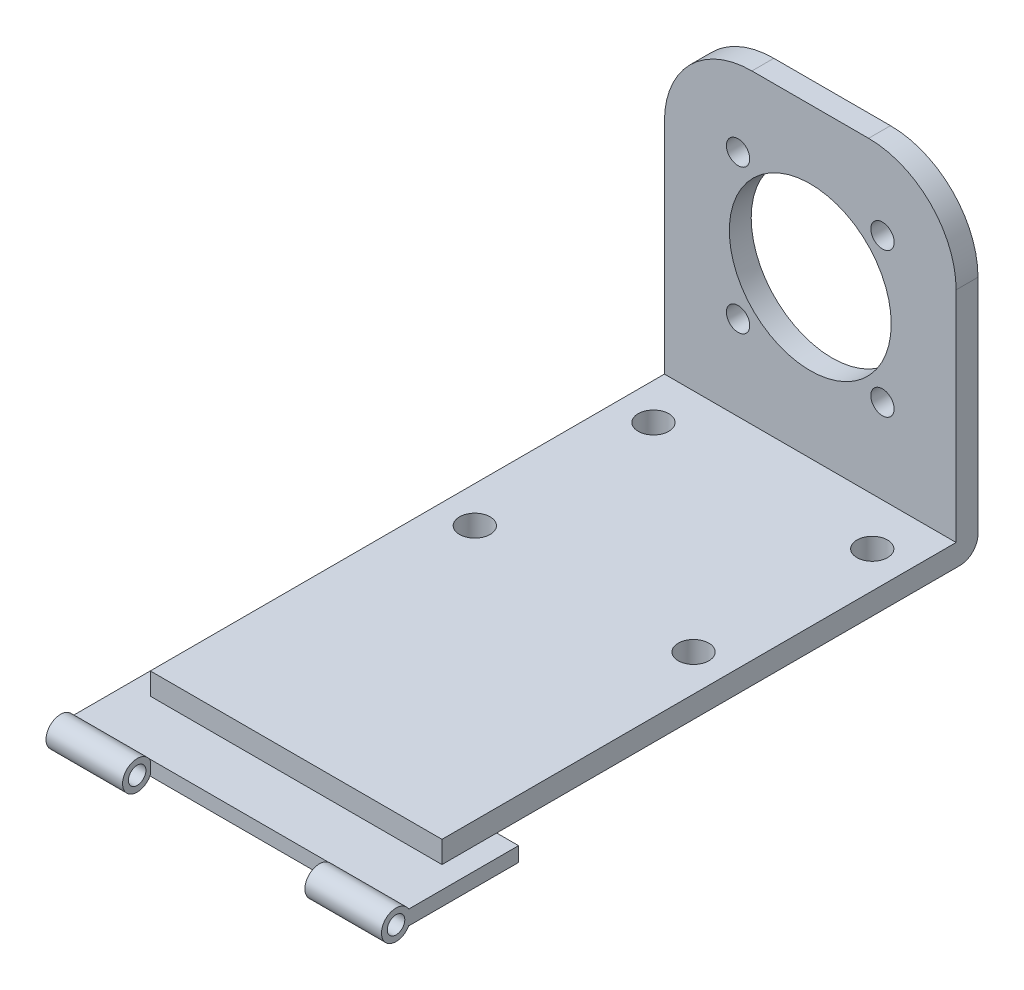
ISO-10303-21;
HEADER;
FILE_DESCRIPTION(('STEP AP214'),'2;1');
FILE_NAME('part.step','',(''),(''),'','','');
FILE_SCHEMA(('AUTOMOTIVE_DESIGN { 1 0 10303 214 1 1 1 1 }'));
ENDSEC;
DATA;
#1=APPLICATION_CONTEXT('core data for automotive mechanical design processes');
#2=APPLICATION_PROTOCOL_DEFINITION('international standard','automotive_design',2000,#1);
#3=PRODUCT_CONTEXT('',#1,'mechanical');
#4=PRODUCT('Part','Part','',(#3));
#5=PRODUCT_RELATED_PRODUCT_CATEGORY('part','',(#4));
#6=PRODUCT_DEFINITION_FORMATION('','',#4);
#7=PRODUCT_DEFINITION_CONTEXT('part definition',#1,'design');
#8=PRODUCT_DEFINITION('design','',#6,#7);
#9=PRODUCT_DEFINITION_SHAPE('','',#8);
#10=(LENGTH_UNIT() NAMED_UNIT(*) SI_UNIT(.MILLI.,.METRE.));
#11=(NAMED_UNIT(*) PLANE_ANGLE_UNIT() SI_UNIT($,.RADIAN.));
#12=(NAMED_UNIT(*) SI_UNIT($,.STERADIAN.) SOLID_ANGLE_UNIT());
#13=UNCERTAINTY_MEASURE_WITH_UNIT(LENGTH_MEASURE(1.E-05),#10,'distance_accuracy_value','');
#14=(GEOMETRIC_REPRESENTATION_CONTEXT(3) GLOBAL_UNCERTAINTY_ASSIGNED_CONTEXT((#13)) GLOBAL_UNIT_ASSIGNED_CONTEXT((#10,
#11,#12)) REPRESENTATION_CONTEXT('',''));
#15=CARTESIAN_POINT('',(0.,0.,0.));
#16=DIRECTION('',(0.,0.,1.));
#17=DIRECTION('',(1.,0.,0.));
#18=AXIS2_PLACEMENT_3D('',#15,#16,#17);
#19=CARTESIAN_POINT('',(0.,-11.580539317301,0.));
#20=DIRECTION('',(0.,-1.,0.));
#21=DIRECTION('',(0.,0.,-1.));
#22=AXIS2_PLACEMENT_3D('',#19,#20,#21);
#23=PLANE('',#22);
#24=DIRECTION('',(0.,0.,1.));
#25=VECTOR('',#24,1.);
#26=CARTESIAN_POINT('',(2.99999999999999,-11.580539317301,0.));
#27=LINE('',#26,#25);
#28=CARTESIAN_POINT('',(2.99999999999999,-11.580539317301,39.8535537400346));
#29=VERTEX_POINT('',#28);
#30=CARTESIAN_POINT('',(2.99999999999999,-11.580539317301,54.8535537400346));
#31=VERTEX_POINT('',#30);
#32=EDGE_CURVE('E588',#29,#31,#27,.T.);
#33=ORIENTED_EDGE('',*,*,#32,.F.);
#34=DIRECTION('',(1.,0.,0.));
#35=VECTOR('',#34,1.);
#36=CARTESIAN_POINT('',(-45.,-11.580539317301,39.8535537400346));
#37=LINE('',#36,#35);
#38=CARTESIAN_POINT('',(0.,-11.580539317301,39.8535537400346));
#39=VERTEX_POINT('',#38);
#40=EDGE_CURVE('E435',#39,#29,#37,.T.);
#41=ORIENTED_EDGE('',*,*,#40,.F.);
#42=DIRECTION('',(0.,0.,-1.));
#43=VECTOR('',#42,1.);
#44=CARTESIAN_POINT('',(0.,-11.580539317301,15.3535537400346));
#45=LINE('',#44,#43);
#46=CARTESIAN_POINT('',(0.,-11.580539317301,47.3535537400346));
#47=VERTEX_POINT('',#46);
#48=EDGE_CURVE('E549',#47,#39,#45,.T.);
#49=ORIENTED_EDGE('',*,*,#48,.F.);
#50=DIRECTION('',(-1.,0.,0.));
#51=VECTOR('',#50,1.);
#52=CARTESIAN_POINT('',(32.1403173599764,-11.580539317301,47.3535537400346));
#53=LINE('',#52,#51);
#54=CARTESIAN_POINT('',(-40.,-11.580539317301,47.3535537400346));
#55=VERTEX_POINT('',#54);
#56=EDGE_CURVE('E442',#47,#55,#53,.T.);
#57=ORIENTED_EDGE('',*,*,#56,.T.);
#58=DIRECTION('',(0.,0.,-1.));
#59=VECTOR('',#58,1.);
#60=CARTESIAN_POINT('',(-40.,-11.580539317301,15.3535537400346));
#61=LINE('',#60,#59);
#62=CARTESIAN_POINT('',(-40.,-11.580539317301,39.8535537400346));
#63=VERTEX_POINT('',#62);
#64=EDGE_CURVE('E536',#55,#63,#61,.T.);
#65=ORIENTED_EDGE('',*,*,#64,.T.);
#66=CARTESIAN_POINT('',(-43.,-11.580539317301,39.8535537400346));
#67=VERTEX_POINT('',#66);
#68=EDGE_CURVE('E427',#67,#63,#37,.T.);
#69=ORIENTED_EDGE('',*,*,#68,.F.);
#70=DIRECTION('',(0.,0.,-1.));
#71=VECTOR('',#70,1.);
#72=CARTESIAN_POINT('',(-43.,-11.580539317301,0.));
#73=LINE('',#72,#71);
#74=CARTESIAN_POINT('',(-43.,-11.580539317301,54.8535537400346));
#75=VERTEX_POINT('',#74);
#76=EDGE_CURVE('E599',#75,#67,#73,.T.);
#77=ORIENTED_EDGE('',*,*,#76,.F.);
#78=DIRECTION('',(-1.,0.,0.));
#79=VECTOR('',#78,1.);
#80=CARTESIAN_POINT('',(-45.,-11.580539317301,54.8535537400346));
#81=LINE('',#80,#79);
#82=EDGE_CURVE('E423',#31,#75,#81,.T.);
#83=ORIENTED_EDGE('',*,*,#82,.F.);
#84=EDGE_LOOP('',(#33,#41,#49,#57,#65,#69,#77,#83));
#85=FACE_BOUND('',#84,.T.);
#86=ADVANCED_FACE('F71',(#85),#23,.F.);
#87=CARTESIAN_POINT('',(-45.,-13.580539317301,54.8535537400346));
#88=DIRECTION('',(0.,0.,-1.));
#89=DIRECTION('',(-1.,0.,0.));
#90=AXIS2_PLACEMENT_3D('',#87,#88,#89);
#91=PLANE('',#90);
#92=DIRECTION('',(0.,-1.,0.));
#93=VECTOR('',#92,1.);
#94=CARTESIAN_POINT('',(2.99999999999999,-13.580539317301,54.8535537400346));
#95=LINE('',#94,#93);
#96=CARTESIAN_POINT('',(2.99999999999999,-11.7087595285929,54.8535537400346));
#97=VERTEX_POINT('',#96);
#98=EDGE_CURVE('E97',#31,#97,#95,.T.);
#99=ORIENTED_EDGE('',*,*,#98,.F.);
#100=ORIENTED_EDGE('',*,*,#82,.T.);
#101=DIRECTION('',(0.,1.,0.));
#102=VECTOR('',#101,1.);
#103=CARTESIAN_POINT('',(-43.,-13.580539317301,54.8535537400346));
#104=LINE('',#103,#102);
#105=CARTESIAN_POINT('',(-43.,-11.7087595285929,54.8535537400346));
#106=VERTEX_POINT('',#105);
#107=EDGE_CURVE('E604',#106,#75,#104,.T.);
#108=ORIENTED_EDGE('',*,*,#107,.F.);
#109=DIRECTION('',(-1.,0.,0.));
#110=VECTOR('',#109,1.);
#111=CARTESIAN_POINT('',(-32.5,-11.7087595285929,54.8535537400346));
#112=LINE('',#111,#110);
#113=CARTESIAN_POINT('',(-32.5,-11.7087595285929,54.8535537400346));
#114=VERTEX_POINT('',#113);
#115=EDGE_CURVE('E409',#106,#114,#112,.F.);
#116=ORIENTED_EDGE('',*,*,#115,.T.);
#117=DIRECTION('',(0.,1.,0.));
#118=VECTOR('',#117,1.);
#119=CARTESIAN_POINT('',(-32.5,-13.580539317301,54.8535537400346));
#120=LINE('',#119,#118);
#121=CARTESIAN_POINT('',(-32.5,-13.4523191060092,54.8535537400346));
#122=VERTEX_POINT('',#121);
#123=EDGE_CURVE('E223',#122,#114,#120,.T.);
#124=ORIENTED_EDGE('',*,*,#123,.F.);
#125=DIRECTION('',(-1.,0.,0.));
#126=VECTOR('',#125,1.);
#127=CARTESIAN_POINT('',(-32.5,-13.4523191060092,54.8535537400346));
#128=LINE('',#127,#126);
#129=CARTESIAN_POINT('',(-43.,-13.4523191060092,54.8535537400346));
#130=VERTEX_POINT('',#129);
#131=EDGE_CURVE('E410',#122,#130,#128,.T.);
#132=ORIENTED_EDGE('',*,*,#131,.T.);
#133=CARTESIAN_POINT('',(-43.,-13.580539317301,54.8535537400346));
#134=VERTEX_POINT('',#133);
#135=EDGE_CURVE('E89',#134,#130,#104,.T.);
#136=ORIENTED_EDGE('',*,*,#135,.F.);
#137=DIRECTION('',(-1.,0.,0.));
#138=VECTOR('',#137,1.);
#139=CARTESIAN_POINT('',(-45.,-13.580539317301,54.8535537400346));
#140=LINE('',#139,#138);
#141=CARTESIAN_POINT('',(2.99999999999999,-13.580539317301,54.8535537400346));
#142=VERTEX_POINT('',#141);
#143=EDGE_CURVE('E212',#142,#134,#140,.T.);
#144=ORIENTED_EDGE('',*,*,#143,.F.);
#145=CARTESIAN_POINT('',(2.99999999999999,-13.4523191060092,54.8535537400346));
#146=VERTEX_POINT('',#145);
#147=EDGE_CURVE('E199',#146,#142,#95,.T.);
#148=ORIENTED_EDGE('',*,*,#147,.F.);
#149=DIRECTION('',(1.,0.,0.));
#150=VECTOR('',#149,1.);
#151=CARTESIAN_POINT('',(-7.50000000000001,-13.4523191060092,54.8535537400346));
#152=LINE('',#151,#150);
#153=CARTESIAN_POINT('',(-7.50000000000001,-13.4523191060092,54.8535537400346));
#154=VERTEX_POINT('',#153);
#155=EDGE_CURVE('E81',#146,#154,#152,.F.);
#156=ORIENTED_EDGE('',*,*,#155,.T.);
#157=DIRECTION('',(0.,-1.,0.));
#158=VECTOR('',#157,1.);
#159=CARTESIAN_POINT('',(-7.50000000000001,-13.580539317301,54.8535537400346));
#160=LINE('',#159,#158);
#161=CARTESIAN_POINT('',(-7.50000000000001,-11.7087595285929,54.8535537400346));
#162=VERTEX_POINT('',#161);
#163=EDGE_CURVE('E220',#162,#154,#160,.T.);
#164=ORIENTED_EDGE('',*,*,#163,.F.);
#165=DIRECTION('',(1.,0.,0.));
#166=VECTOR('',#165,1.);
#167=CARTESIAN_POINT('',(-7.50000000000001,-11.7087595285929,54.8535537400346));
#168=LINE('',#167,#166);
#169=EDGE_CURVE('E12',#162,#97,#168,.T.);
#170=ORIENTED_EDGE('',*,*,#169,.T.);
#171=EDGE_LOOP('',(#99,#100,#108,#116,#124,#132,#136,#144,#148,#156,#164,#170));
#172=FACE_BOUND('',#171,.T.);
#173=ADVANCED_FACE('F209',(#172),#91,.F.);
#174=CARTESIAN_POINT('',(-45.,-13.580539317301,39.8535537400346));
#175=DIRECTION('',(0.,0.,1.));
#176=DIRECTION('',(1.,0.,0.));
#177=AXIS2_PLACEMENT_3D('',#174,#175,#176);
#178=PLANE('',#177);
#179=DIRECTION('',(0.,1.,0.));
#180=VECTOR('',#179,1.);
#181=CARTESIAN_POINT('',(2.99999999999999,-13.580539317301,39.8535537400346));
#182=LINE('',#181,#180);
#183=CARTESIAN_POINT('',(2.99999999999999,-13.580539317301,39.8535537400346));
#184=VERTEX_POINT('',#183);
#185=EDGE_CURVE('E612',#184,#29,#182,.T.);
#186=ORIENTED_EDGE('',*,*,#185,.F.);
#187=DIRECTION('',(1.,0.,0.));
#188=VECTOR('',#187,1.);
#189=CARTESIAN_POINT('',(-45.,-13.580539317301,39.8535537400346));
#190=LINE('',#189,#188);
#191=CARTESIAN_POINT('',(-43.,-13.580539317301,39.8535537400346));
#192=VERTEX_POINT('',#191);
#193=EDGE_CURVE('E426',#192,#184,#190,.T.);
#194=ORIENTED_EDGE('',*,*,#193,.F.);
#195=DIRECTION('',(0.,-1.,0.));
#196=VECTOR('',#195,1.);
#197=CARTESIAN_POINT('',(-43.,-13.580539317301,39.8535537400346));
#198=LINE('',#197,#196);
#199=EDGE_CURVE('E623',#67,#192,#198,.T.);
#200=ORIENTED_EDGE('',*,*,#199,.F.);
#201=ORIENTED_EDGE('',*,*,#68,.T.);
#202=EDGE_CURVE('E438',#63,#39,#37,.T.);
#203=ORIENTED_EDGE('',*,*,#202,.T.);
#204=ORIENTED_EDGE('',*,*,#40,.T.);
#205=EDGE_LOOP('',(#186,#194,#200,#201,#203,#204));
#206=FACE_BOUND('',#205,.T.);
#207=ADVANCED_FACE('F255',(#206),#178,.F.);
#208=CARTESIAN_POINT('',(0.,-13.580539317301,0.));
#209=DIRECTION('',(0.,-1.,0.));
#210=DIRECTION('',(0.,0.,-1.));
#211=AXIS2_PLACEMENT_3D('',#208,#209,#210);
#212=PLANE('',#211);
#213=ORIENTED_EDGE('',*,*,#193,.T.);
#214=DIRECTION('',(0.,0.,1.));
#215=VECTOR('',#214,1.);
#216=CARTESIAN_POINT('',(2.99999999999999,-13.580539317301,0.));
#217=LINE('',#216,#215);
#218=EDGE_CURVE('E607',#184,#142,#217,.T.);
#219=ORIENTED_EDGE('',*,*,#218,.T.);
#220=ORIENTED_EDGE('',*,*,#143,.T.);
#221=DIRECTION('',(0.,0.,-1.));
#222=VECTOR('',#221,1.);
#223=CARTESIAN_POINT('',(-43.,-13.580539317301,0.));
#224=LINE('',#223,#222);
#225=EDGE_CURVE('E601',#134,#192,#224,.T.);
#226=ORIENTED_EDGE('',*,*,#225,.T.);
#227=EDGE_LOOP('',(#213,#219,#220,#226));
#228=FACE_BOUND('',#227,.T.);
#229=ADVANCED_FACE('F260',(#228),#212,.T.);
#230=CARTESIAN_POINT('',(-32.5,-12.580539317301,56.6535537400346));
#231=DIRECTION('',(-1.,0.,0.));
#232=DIRECTION('',(0.,0.,1.));
#233=AXIS2_PLACEMENT_3D('',#230,#231,#232);
#234=CYLINDRICAL_SURFACE('',#233,2.);
#235=ORIENTED_EDGE('',*,*,#115,.F.);
#236=CARTESIAN_POINT('',(-43.,-12.580539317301,56.6535537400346));
#237=DIRECTION('',(-1.,0.,0.));
#238=DIRECTION('',(0.,0.,1.));
#239=AXIS2_PLACEMENT_3D('',#236,#237,#238);
#240=CIRCLE('',#239,2.);
#241=EDGE_CURVE('E615',#106,#130,#240,.F.);
#242=ORIENTED_EDGE('',*,*,#241,.T.);
#243=ORIENTED_EDGE('',*,*,#131,.F.);
#244=CARTESIAN_POINT('',(-32.5,-12.580539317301,56.6535537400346));
#245=DIRECTION('',(-1.,0.,0.));
#246=DIRECTION('',(0.,0.,1.));
#247=AXIS2_PLACEMENT_3D('',#244,#245,#246);
#248=CIRCLE('',#247,2.);
#249=EDGE_CURVE('E404',#122,#114,#248,.T.);
#250=ORIENTED_EDGE('',*,*,#249,.T.);
#251=EDGE_LOOP('',(#235,#242,#243,#250));
#252=FACE_BOUND('',#251,.T.);
#253=ADVANCED_FACE('F408',(#252),#234,.T.);
#254=CARTESIAN_POINT('',(-32.5,-12.580539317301,56.6535537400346));
#255=DIRECTION('',(-1.,0.,0.));
#256=DIRECTION('',(0.,0.,1.));
#257=AXIS2_PLACEMENT_3D('',#254,#255,#256);
#258=CYLINDRICAL_SURFACE('',#257,1.2);
#259=CARTESIAN_POINT('',(-32.5,-12.580539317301,56.6535537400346));
#260=DIRECTION('',(-1.,0.,0.));
#261=DIRECTION('',(0.,0.,1.));
#262=AXIS2_PLACEMENT_3D('',#259,#260,#261);
#263=CIRCLE('',#262,1.2);
#264=CARTESIAN_POINT('',(-32.5,-12.580539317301,57.8535537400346));
#265=VERTEX_POINT('',#264);
#266=EDGE_CURVE('E412',#265,#265,#263,.T.);
#267=ORIENTED_EDGE('',*,*,#266,.F.);
#268=EDGE_LOOP('',(#267));
#269=FACE_BOUND('',#268,.T.);
#270=CARTESIAN_POINT('',(-43.,-12.580539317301,56.6535537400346));
#271=DIRECTION('',(-1.,0.,0.));
#272=DIRECTION('',(0.,0.,1.));
#273=AXIS2_PLACEMENT_3D('',#270,#271,#272);
#274=CIRCLE('',#273,1.2);
#275=CARTESIAN_POINT('',(-43.,-12.580539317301,57.8535537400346));
#276=VERTEX_POINT('',#275);
#277=EDGE_CURVE('E75',#276,#276,#274,.F.);
#278=ORIENTED_EDGE('',*,*,#277,.F.);
#279=EDGE_LOOP('',(#278));
#280=FACE_BOUND('',#279,.T.);
#281=ADVANCED_FACE('F243',(#269,#280),#258,.F.);
#282=CARTESIAN_POINT('',(-7.50000000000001,-12.580539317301,56.6535537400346));
#283=DIRECTION('',(1.,0.,0.));
#284=DIRECTION('',(0.,0.,-1.));
#285=AXIS2_PLACEMENT_3D('',#282,#283,#284);
#286=CYLINDRICAL_SURFACE('',#285,2.);
#287=ORIENTED_EDGE('',*,*,#155,.F.);
#288=CARTESIAN_POINT('',(2.99999999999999,-12.580539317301,56.6535537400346));
#289=DIRECTION('',(1.,0.,0.));
#290=DIRECTION('',(0.,0.,-1.));
#291=AXIS2_PLACEMENT_3D('',#288,#289,#290);
#292=CIRCLE('',#291,2.);
#293=EDGE_CURVE('E196',#146,#97,#292,.F.);
#294=ORIENTED_EDGE('',*,*,#293,.T.);
#295=ORIENTED_EDGE('',*,*,#169,.F.);
#296=CARTESIAN_POINT('',(-7.50000000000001,-12.580539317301,56.6535537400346));
#297=DIRECTION('',(1.,0.,0.));
#298=DIRECTION('',(0.,0.,-1.));
#299=AXIS2_PLACEMENT_3D('',#296,#297,#298);
#300=CIRCLE('',#299,2.);
#301=EDGE_CURVE('E218',#162,#154,#300,.T.);
#302=ORIENTED_EDGE('',*,*,#301,.T.);
#303=EDGE_LOOP('',(#287,#294,#295,#302));
#304=FACE_BOUND('',#303,.T.);
#305=ADVANCED_FACE('F216',(#304),#286,.T.);
#306=CARTESIAN_POINT('',(-7.50000000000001,-12.580539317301,56.6535537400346));
#307=DIRECTION('',(1.,0.,0.));
#308=DIRECTION('',(0.,0.,-1.));
#309=AXIS2_PLACEMENT_3D('',#306,#307,#308);
#310=CYLINDRICAL_SURFACE('',#309,1.2);
#311=CARTESIAN_POINT('',(-7.50000000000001,-12.580539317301,56.6535537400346));
#312=DIRECTION('',(1.,0.,0.));
#313=DIRECTION('',(0.,0.,-1.));
#314=AXIS2_PLACEMENT_3D('',#311,#312,#313);
#315=CIRCLE('',#314,1.2);
#316=CARTESIAN_POINT('',(-7.50000000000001,-12.580539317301,55.4535537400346));
#317=VERTEX_POINT('',#316);
#318=EDGE_CURVE('E626',#317,#317,#315,.T.);
#319=ORIENTED_EDGE('',*,*,#318,.F.);
#320=EDGE_LOOP('',(#319));
#321=FACE_BOUND('',#320,.T.);
#322=CARTESIAN_POINT('',(2.99999999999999,-12.580539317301,56.6535537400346));
#323=DIRECTION('',(1.,0.,0.));
#324=DIRECTION('',(0.,0.,-1.));
#325=AXIS2_PLACEMENT_3D('',#322,#323,#324);
#326=CIRCLE('',#325,1.2);
#327=CARTESIAN_POINT('',(2.99999999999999,-12.580539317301,55.4535537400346));
#328=VERTEX_POINT('',#327);
#329=EDGE_CURVE('E205',#328,#328,#326,.F.);
#330=ORIENTED_EDGE('',*,*,#329,.F.);
#331=EDGE_LOOP('',(#330));
#332=FACE_BOUND('',#331,.T.);
#333=ADVANCED_FACE('F231',(#321,#332),#310,.F.);
#334=CARTESIAN_POINT('',(-40.,-11.580539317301,15.3535537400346));
#335=DIRECTION('',(0.,-1.,0.));
#336=DIRECTION('',(0.,0.,-1.));
#337=AXIS2_PLACEMENT_3D('',#334,#335,#336);
#338=PLANE('',#337);
#339=CARTESIAN_POINT('',(-35.,-11.580539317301,-16.6464462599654));
#340=DIRECTION('',(0.,-1.,0.));
#341=DIRECTION('',(0.,0.,-1.));
#342=AXIS2_PLACEMENT_3D('',#339,#340,#341);
#343=CIRCLE('',#342,2.1);
#344=CARTESIAN_POINT('',(-35.,-11.580539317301,-18.7464462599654));
#345=VERTEX_POINT('',#344);
#346=EDGE_CURVE('E482',#345,#345,#343,.T.);
#347=ORIENTED_EDGE('',*,*,#346,.F.);
#348=EDGE_LOOP('',(#347));
#349=FACE_BOUND('',#348,.T.);
#350=CARTESIAN_POINT('',(-5.,-11.580539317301,7.85355374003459));
#351=DIRECTION('',(0.,-1.,0.));
#352=DIRECTION('',(0.,0.,-1.));
#353=AXIS2_PLACEMENT_3D('',#350,#351,#352);
#354=CIRCLE('',#353,2.1);
#355=CARTESIAN_POINT('',(-5.,-11.580539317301,5.75355374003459));
#356=VERTEX_POINT('',#355);
#357=EDGE_CURVE('E478',#356,#356,#354,.T.);
#358=ORIENTED_EDGE('',*,*,#357,.F.);
#359=EDGE_LOOP('',(#358));
#360=FACE_BOUND('',#359,.T.);
#361=CARTESIAN_POINT('',(-5.,-11.580539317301,-16.6464462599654));
#362=DIRECTION('',(0.,-1.,0.));
#363=DIRECTION('',(0.,0.,-1.));
#364=AXIS2_PLACEMENT_3D('',#361,#362,#363);
#365=CIRCLE('',#364,2.1);
#366=CARTESIAN_POINT('',(-5.,-11.580539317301,-18.7464462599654));
#367=VERTEX_POINT('',#366);
#368=EDGE_CURVE('E474',#367,#367,#365,.T.);
#369=ORIENTED_EDGE('',*,*,#368,.F.);
#370=EDGE_LOOP('',(#369));
#371=FACE_BOUND('',#370,.T.);
#372=CARTESIAN_POINT('',(-35.,-11.580539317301,7.8535537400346));
#373=DIRECTION('',(0.,-1.,0.));
#374=DIRECTION('',(0.,0.,-1.));
#375=AXIS2_PLACEMENT_3D('',#372,#373,#374);
#376=CIRCLE('',#375,2.1);
#377=CARTESIAN_POINT('',(-35.,-11.580539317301,5.7535537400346));
#378=VERTEX_POINT('',#377);
#379=EDGE_CURVE('E470',#378,#378,#376,.T.);
#380=ORIENTED_EDGE('',*,*,#379,.F.);
#381=EDGE_LOOP('',(#380));
#382=FACE_BOUND('',#381,.T.);
#383=CARTESIAN_POINT('',(0.,-11.580539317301,-23.6464462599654));
#384=VERTEX_POINT('',#383);
#385=EDGE_CURVE('E548',#39,#384,#45,.T.);
#386=ORIENTED_EDGE('',*,*,#385,.F.);
#387=ORIENTED_EDGE('',*,*,#202,.F.);
#388=CARTESIAN_POINT('',(-40.,-11.580539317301,-23.6464462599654));
#389=VERTEX_POINT('',#388);
#390=EDGE_CURVE('E535',#63,#389,#61,.T.);
#391=ORIENTED_EDGE('',*,*,#390,.T.);
#392=DIRECTION('',(1.,0.,0.));
#393=VECTOR('',#392,1.);
#394=CARTESIAN_POINT('',(-40.,-11.580539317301,-23.6464462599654));
#395=LINE('',#394,#393);
#396=EDGE_CURVE('E384',#389,#384,#395,.T.);
#397=ORIENTED_EDGE('',*,*,#396,.T.);
#398=EDGE_LOOP('',(#386,#387,#391,#397));
#399=FACE_BOUND('',#398,.T.);
#400=ADVANCED_FACE('F233',(#349,#360,#371,#382,#399),#338,.T.);
#401=CARTESIAN_POINT('',(-40.,33.419460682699,-26.1464462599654));
#402=DIRECTION('',(0.,1.,0.));
#403=DIRECTION('',(0.,0.,1.));
#404=AXIS2_PLACEMENT_3D('',#401,#402,#403);
#405=PLANE('',#404);
#406=DIRECTION('',(1.,0.,0.));
#407=VECTOR('',#406,1.);
#408=CARTESIAN_POINT('',(-40.,33.419460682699,-23.1464462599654));
#409=LINE('',#408,#407);
#410=CARTESIAN_POINT('',(-27.9999999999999,33.419460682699,-23.1464462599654));
#411=VERTEX_POINT('',#410);
#412=CARTESIAN_POINT('',(-12.0000000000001,33.419460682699,-23.1464462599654));
#413=VERTEX_POINT('',#412);
#414=EDGE_CURVE('E364',#411,#413,#409,.T.);
#415=ORIENTED_EDGE('',*,*,#414,.T.);
#416=DIRECTION('',(0.,0.,1.));
#417=VECTOR('',#416,1.);
#418=CARTESIAN_POINT('',(-12.0000000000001,33.419460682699,-63.1464462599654));
#419=LINE('',#418,#417);
#420=CARTESIAN_POINT('',(-12.0000000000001,33.419460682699,-26.1464462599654));
#421=VERTEX_POINT('',#420);
#422=EDGE_CURVE('E369',#421,#413,#419,.T.);
#423=ORIENTED_EDGE('',*,*,#422,.F.);
#424=DIRECTION('',(1.,0.,0.));
#425=VECTOR('',#424,1.);
#426=CARTESIAN_POINT('',(-40.,33.419460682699,-26.1464462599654));
#427=LINE('',#426,#425);
#428=CARTESIAN_POINT('',(-27.9999999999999,33.419460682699,-26.1464462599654));
#429=VERTEX_POINT('',#428);
#430=EDGE_CURVE('E395',#429,#421,#427,.T.);
#431=ORIENTED_EDGE('',*,*,#430,.F.);
#432=DIRECTION('',(0.,0.,1.));
#433=VECTOR('',#432,1.);
#434=CARTESIAN_POINT('',(-27.9999999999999,33.419460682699,-63.1464462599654));
#435=LINE('',#434,#433);
#436=EDGE_CURVE('E377',#429,#411,#435,.T.);
#437=ORIENTED_EDGE('',*,*,#436,.T.);
#438=EDGE_LOOP('',(#415,#423,#431,#437));
#439=FACE_BOUND('',#438,.T.);
#440=ADVANCED_FACE('F73',(#439),#405,.T.);
#441=CARTESIAN_POINT('',(-40.,-9.08053931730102,-26.1464462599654));
#442=DIRECTION('',(0.,0.,-1.));
#443=DIRECTION('',(-1.,0.,0.));
#444=AXIS2_PLACEMENT_3D('',#441,#442,#443);
#445=PLANE('',#444);
#446=CARTESIAN_POINT('',(-29.8994949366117,22.8189556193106,-26.1464462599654));
#447=DIRECTION('',(0.,0.,-1.));
#448=DIRECTION('',(-1.,0.,0.));
#449=AXIS2_PLACEMENT_3D('',#446,#447,#448);
#450=CIRCLE('',#449,1.6);
#451=CARTESIAN_POINT('',(-31.4994949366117,22.8189556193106,-26.1464462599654));
#452=VERTEX_POINT('',#451);
#453=EDGE_CURVE('E524',#452,#452,#450,.T.);
#454=ORIENTED_EDGE('',*,*,#453,.F.);
#455=EDGE_LOOP('',(#454));
#456=FACE_BOUND('',#455,.T.);
#457=CARTESIAN_POINT('',(-10.1005050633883,22.8189556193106,-26.1464462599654));
#458=DIRECTION('',(0.,0.,-1.));
#459=DIRECTION('',(-1.,0.,0.));
#460=AXIS2_PLACEMENT_3D('',#457,#458,#459);
#461=CIRCLE('',#460,1.6);
#462=CARTESIAN_POINT('',(-11.7005050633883,22.8189556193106,-26.1464462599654));
#463=VERTEX_POINT('',#462);
#464=EDGE_CURVE('E520',#463,#463,#461,.T.);
#465=ORIENTED_EDGE('',*,*,#464,.F.);
#466=EDGE_LOOP('',(#465));
#467=FACE_BOUND('',#466,.T.);
#468=CARTESIAN_POINT('',(-10.1005050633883,3.01996574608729,-26.1464462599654));
#469=DIRECTION('',(0.,0.,-1.));
#470=DIRECTION('',(-1.,0.,0.));
#471=AXIS2_PLACEMENT_3D('',#468,#469,#470);
#472=CIRCLE('',#471,1.6);
#473=CARTESIAN_POINT('',(-11.7005050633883,3.01996574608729,-26.1464462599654));
#474=VERTEX_POINT('',#473);
#475=EDGE_CURVE('E516',#474,#474,#472,.T.);
#476=ORIENTED_EDGE('',*,*,#475,.F.);
#477=EDGE_LOOP('',(#476));
#478=FACE_BOUND('',#477,.T.);
#479=CARTESIAN_POINT('',(-29.8994949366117,3.01996574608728,-26.1464462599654));
#480=DIRECTION('',(0.,0.,-1.));
#481=DIRECTION('',(-1.,0.,0.));
#482=AXIS2_PLACEMENT_3D('',#479,#480,#481);
#483=CIRCLE('',#482,1.6);
#484=CARTESIAN_POINT('',(-31.4994949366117,3.01996574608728,-26.1464462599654));
#485=VERTEX_POINT('',#484);
#486=EDGE_CURVE('E512',#485,#485,#483,.T.);
#487=ORIENTED_EDGE('',*,*,#486,.F.);
#488=EDGE_LOOP('',(#487));
#489=FACE_BOUND('',#488,.T.);
#490=CARTESIAN_POINT('',(-20.,12.919460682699,-26.1464462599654));
#491=DIRECTION('',(0.,0.,-1.));
#492=DIRECTION('',(-1.,0.,0.));
#493=AXIS2_PLACEMENT_3D('',#490,#491,#492);
#494=CIRCLE('',#493,11.1);
#495=CARTESIAN_POINT('',(-31.1,12.919460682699,-26.1464462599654));
#496=VERTEX_POINT('',#495);
#497=EDGE_CURVE('E508',#496,#496,#494,.T.);
#498=ORIENTED_EDGE('',*,*,#497,.F.);
#499=EDGE_LOOP('',(#498));
#500=FACE_BOUND('',#499,.T.);
#501=CARTESIAN_POINT('',(-12.,21.419460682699,-26.1464462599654));
#502=DIRECTION('',(0.,0.,-1.));
#503=DIRECTION('',(-1.,0.,0.));
#504=AXIS2_PLACEMENT_3D('',#501,#502,#503);
#505=CIRCLE('',#504,12.);
#506=CARTESIAN_POINT('',(0.,21.4194606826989,-26.1464462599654));
#507=VERTEX_POINT('',#506);
#508=EDGE_CURVE('E488',#507,#421,#505,.F.);
#509=ORIENTED_EDGE('',*,*,#508,.F.);
#510=DIRECTION('',(0.,1.,0.));
#511=VECTOR('',#510,1.);
#512=CARTESIAN_POINT('',(0.,-9.08053931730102,-26.1464462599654));
#513=LINE('',#512,#511);
#514=CARTESIAN_POINT('',(0.,-9.08053931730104,-26.1464462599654));
#515=VERTEX_POINT('',#514);
#516=EDGE_CURVE('E532',#515,#507,#513,.T.);
#517=ORIENTED_EDGE('',*,*,#516,.F.);
#518=DIRECTION('',(1.,0.,0.));
#519=VECTOR('',#518,1.);
#520=CARTESIAN_POINT('',(-40.,-9.08053931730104,-26.1464462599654));
#521=LINE('',#520,#519);
#522=CARTESIAN_POINT('',(-40.,-9.08053931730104,-26.1464462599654));
#523=VERTEX_POINT('',#522);
#524=EDGE_CURVE('E562',#523,#515,#521,.T.);
#525=ORIENTED_EDGE('',*,*,#524,.F.);
#526=DIRECTION('',(0.,1.,0.));
#527=VECTOR('',#526,1.);
#528=CARTESIAN_POINT('',(-40.,-9.08053931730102,-26.1464462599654));
#529=LINE('',#528,#527);
#530=CARTESIAN_POINT('',(-40.,21.4194606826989,-26.1464462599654));
#531=VERTEX_POINT('',#530);
#532=EDGE_CURVE('E380',#523,#531,#529,.T.);
#533=ORIENTED_EDGE('',*,*,#532,.T.);
#534=CARTESIAN_POINT('',(-28.,21.419460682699,-26.1464462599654));
#535=DIRECTION('',(0.,0.,-1.));
#536=DIRECTION('',(-1.,0.,0.));
#537=AXIS2_PLACEMENT_3D('',#534,#535,#536);
#538=CIRCLE('',#537,12.);
#539=EDGE_CURVE('E495',#429,#531,#538,.F.);
#540=ORIENTED_EDGE('',*,*,#539,.F.);
#541=ORIENTED_EDGE('',*,*,#430,.T.);
#542=EDGE_LOOP('',(#509,#517,#525,#533,#540,#541));
#543=FACE_BOUND('',#542,.T.);
#544=ADVANCED_FACE('F323',(#456,#467,#478,#489,#500,#543),#445,.T.);
#545=CARTESIAN_POINT('',(-40.,33.419460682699,-23.1464462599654));
#546=DIRECTION('',(0.,0.,1.));
#547=DIRECTION('',(0.,-1.,0.));
#548=AXIS2_PLACEMENT_3D('',#545,#546,#547);
#549=PLANE('',#548);
#550=CARTESIAN_POINT('',(-29.8994949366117,22.8189556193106,-23.1464462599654));
#551=DIRECTION('',(0.,0.,1.));
#552=DIRECTION('',(1.,0.,0.));
#553=AXIS2_PLACEMENT_3D('',#550,#551,#552);
#554=CIRCLE('',#553,1.6);
#555=CARTESIAN_POINT('',(-28.2994949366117,22.8189556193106,-23.1464462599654));
#556=VERTEX_POINT('',#555);
#557=EDGE_CURVE('E341',#556,#556,#554,.T.);
#558=ORIENTED_EDGE('',*,*,#557,.F.);
#559=EDGE_LOOP('',(#558));
#560=FACE_BOUND('',#559,.T.);
#561=CARTESIAN_POINT('',(-10.1005050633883,22.8189556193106,-23.1464462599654));
#562=DIRECTION('',(0.,0.,1.));
#563=DIRECTION('',(1.,0.,0.));
#564=AXIS2_PLACEMENT_3D('',#561,#562,#563);
#565=CIRCLE('',#564,1.6);
#566=CARTESIAN_POINT('',(-8.50050506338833,22.8189556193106,-23.1464462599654));
#567=VERTEX_POINT('',#566);
#568=EDGE_CURVE('E345',#567,#567,#565,.T.);
#569=ORIENTED_EDGE('',*,*,#568,.F.);
#570=EDGE_LOOP('',(#569));
#571=FACE_BOUND('',#570,.T.);
#572=CARTESIAN_POINT('',(-10.1005050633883,3.01996574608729,-23.1464462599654));
#573=DIRECTION('',(0.,0.,1.));
#574=DIRECTION('',(1.,0.,0.));
#575=AXIS2_PLACEMENT_3D('',#572,#573,#574);
#576=CIRCLE('',#575,1.6);
#577=CARTESIAN_POINT('',(-8.50050506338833,3.01996574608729,-23.1464462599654));
#578=VERTEX_POINT('',#577);
#579=EDGE_CURVE('E349',#578,#578,#576,.T.);
#580=ORIENTED_EDGE('',*,*,#579,.F.);
#581=EDGE_LOOP('',(#580));
#582=FACE_BOUND('',#581,.T.);
#583=CARTESIAN_POINT('',(-29.8994949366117,3.01996574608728,-23.1464462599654));
#584=DIRECTION('',(0.,0.,1.));
#585=DIRECTION('',(1.,0.,0.));
#586=AXIS2_PLACEMENT_3D('',#583,#584,#585);
#587=CIRCLE('',#586,1.6);
#588=CARTESIAN_POINT('',(-28.2994949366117,3.01996574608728,-23.1464462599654));
#589=VERTEX_POINT('',#588);
#590=EDGE_CURVE('E353',#589,#589,#587,.T.);
#591=ORIENTED_EDGE('',*,*,#590,.F.);
#592=EDGE_LOOP('',(#591));
#593=FACE_BOUND('',#592,.T.);
#594=CARTESIAN_POINT('',(-20.,12.919460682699,-23.1464462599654));
#595=DIRECTION('',(0.,0.,1.));
#596=DIRECTION('',(1.,0.,0.));
#597=AXIS2_PLACEMENT_3D('',#594,#595,#596);
#598=CIRCLE('',#597,11.1);
#599=CARTESIAN_POINT('',(-8.9,12.919460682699,-23.1464462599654));
#600=VERTEX_POINT('',#599);
#601=EDGE_CURVE('E357',#600,#600,#598,.T.);
#602=ORIENTED_EDGE('',*,*,#601,.F.);
#603=EDGE_LOOP('',(#602));
#604=FACE_BOUND('',#603,.T.);
#605=CARTESIAN_POINT('',(-12.,21.419460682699,-23.1464462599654));
#606=DIRECTION('',(0.,0.,-1.));
#607=DIRECTION('',(-1.,0.,0.));
#608=AXIS2_PLACEMENT_3D('',#605,#606,#607);
#609=CIRCLE('',#608,12.);
#610=CARTESIAN_POINT('',(0.,21.4194606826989,-23.1464462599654));
#611=VERTEX_POINT('',#610);
#612=EDGE_CURVE('E361',#413,#611,#609,.T.);
#613=ORIENTED_EDGE('',*,*,#612,.F.);
#614=ORIENTED_EDGE('',*,*,#414,.F.);
#615=CARTESIAN_POINT('',(-28.,21.419460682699,-23.1464462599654));
#616=DIRECTION('',(0.,0.,-1.));
#617=DIRECTION('',(1.,0.,0.));
#618=AXIS2_PLACEMENT_3D('',#615,#616,#617);
#619=CIRCLE('',#618,12.);
#620=CARTESIAN_POINT('',(-40.,21.4194606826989,-23.1464462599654));
#621=VERTEX_POINT('',#620);
#622=EDGE_CURVE('E370',#621,#411,#619,.T.);
#623=ORIENTED_EDGE('',*,*,#622,.F.);
#624=DIRECTION('',(0.,-1.,0.));
#625=VECTOR('',#624,1.);
#626=CARTESIAN_POINT('',(-40.,33.419460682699,-23.1464462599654));
#627=LINE('',#626,#625);
#628=CARTESIAN_POINT('',(-40.,-8.58053931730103,-23.1464462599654));
#629=VERTEX_POINT('',#628);
#630=EDGE_CURVE('E528',#621,#629,#627,.T.);
#631=ORIENTED_EDGE('',*,*,#630,.T.);
#632=DIRECTION('',(1.,0.,0.));
#633=VECTOR('',#632,1.);
#634=CARTESIAN_POINT('',(-40.,-8.58053931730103,-23.1464462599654));
#635=LINE('',#634,#633);
#636=CARTESIAN_POINT('',(0.,-8.58053931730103,-23.1464462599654));
#637=VERTEX_POINT('',#636);
#638=EDGE_CURVE('E379',#629,#637,#635,.T.);
#639=ORIENTED_EDGE('',*,*,#638,.T.);
#640=DIRECTION('',(0.,-1.,0.));
#641=VECTOR('',#640,1.);
#642=CARTESIAN_POINT('',(0.,33.419460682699,-23.1464462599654));
#643=LINE('',#642,#641);
#644=EDGE_CURVE('E366',#611,#637,#643,.T.);
#645=ORIENTED_EDGE('',*,*,#644,.F.);
#646=EDGE_LOOP('',(#613,#614,#623,#631,#639,#645));
#647=FACE_BOUND('',#646,.T.);
#648=ADVANCED_FACE('F326',(#560,#571,#582,#593,#604,#647),#549,.T.);
#649=CARTESIAN_POINT('',(-40.,-9.08053931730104,-23.6464462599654));
#650=DIRECTION('',(1.,0.,0.));
#651=DIRECTION('',(0.,0.,-1.));
#652=AXIS2_PLACEMENT_3D('',#649,#650,#651);
#653=CYLINDRICAL_SURFACE('',#652,2.5);
#654=CARTESIAN_POINT('',(0.,-9.08053931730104,-23.6464462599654));
#655=DIRECTION('',(1.,0.,0.));
#656=DIRECTION('',(0.,0.,-1.));
#657=AXIS2_PLACEMENT_3D('',#654,#655,#656);
#658=CIRCLE('',#657,2.5);
#659=EDGE_CURVE('E553',#384,#515,#658,.T.);
#660=ORIENTED_EDGE('',*,*,#659,.F.);
#661=ORIENTED_EDGE('',*,*,#396,.F.);
#662=CARTESIAN_POINT('',(-40.,-9.08053931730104,-23.6464462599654));
#663=DIRECTION('',(1.,0.,0.));
#664=DIRECTION('',(0.,0.,-1.));
#665=AXIS2_PLACEMENT_3D('',#662,#663,#664);
#666=CIRCLE('',#665,2.5);
#667=EDGE_CURVE('E387',#389,#523,#666,.T.);
#668=ORIENTED_EDGE('',*,*,#667,.T.);
#669=ORIENTED_EDGE('',*,*,#524,.T.);
#670=EDGE_LOOP('',(#660,#661,#668,#669));
#671=FACE_BOUND('',#670,.T.);
#672=ADVANCED_FACE('F328',(#671),#653,.T.);
#673=CARTESIAN_POINT('',(-40.,-8.58053931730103,-23.1464462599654));
#674=DIRECTION('',(0.,1.,0.));
#675=DIRECTION('',(0.,0.,1.));
#676=AXIS2_PLACEMENT_3D('',#673,#674,#675);
#677=PLANE('',#676);
#678=CARTESIAN_POINT('',(-35.,-8.58053931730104,-16.6464462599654));
#679=DIRECTION('',(0.,1.,0.));
#680=DIRECTION('',(0.,0.,1.));
#681=AXIS2_PLACEMENT_3D('',#678,#679,#680);
#682=CIRCLE('',#681,2.1);
#683=CARTESIAN_POINT('',(-35.,-8.58053931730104,-14.5464462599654));
#684=VERTEX_POINT('',#683);
#685=EDGE_CURVE('E459',#684,#684,#682,.T.);
#686=ORIENTED_EDGE('',*,*,#685,.F.);
#687=EDGE_LOOP('',(#686));
#688=FACE_BOUND('',#687,.T.);
#689=CARTESIAN_POINT('',(-5.,-8.58053931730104,7.85355374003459));
#690=DIRECTION('',(0.,1.,0.));
#691=DIRECTION('',(0.,0.,1.));
#692=AXIS2_PLACEMENT_3D('',#689,#690,#691);
#693=CIRCLE('',#692,2.1);
#694=CARTESIAN_POINT('',(-5.,-8.58053931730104,9.95355374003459));
#695=VERTEX_POINT('',#694);
#696=EDGE_CURVE('E458',#695,#695,#693,.T.);
#697=ORIENTED_EDGE('',*,*,#696,.F.);
#698=EDGE_LOOP('',(#697));
#699=FACE_BOUND('',#698,.T.);
#700=CARTESIAN_POINT('',(-5.,-8.58053931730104,-16.6464462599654));
#701=DIRECTION('',(0.,1.,0.));
#702=DIRECTION('',(0.,0.,1.));
#703=AXIS2_PLACEMENT_3D('',#700,#701,#702);
#704=CIRCLE('',#703,2.1);
#705=CARTESIAN_POINT('',(-5.,-8.58053931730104,-14.5464462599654));
#706=VERTEX_POINT('',#705);
#707=EDGE_CURVE('E451',#706,#706,#704,.T.);
#708=ORIENTED_EDGE('',*,*,#707,.F.);
#709=EDGE_LOOP('',(#708));
#710=FACE_BOUND('',#709,.T.);
#711=CARTESIAN_POINT('',(-35.,-8.58053931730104,7.8535537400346));
#712=DIRECTION('',(0.,1.,0.));
#713=DIRECTION('',(0.,0.,1.));
#714=AXIS2_PLACEMENT_3D('',#711,#712,#713);
#715=CIRCLE('',#714,2.1);
#716=CARTESIAN_POINT('',(-35.,-8.58053931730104,9.95355374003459));
#717=VERTEX_POINT('',#716);
#718=EDGE_CURVE('E463',#717,#717,#715,.T.);
#719=ORIENTED_EDGE('',*,*,#718,.F.);
#720=EDGE_LOOP('',(#719));
#721=FACE_BOUND('',#720,.T.);
#722=DIRECTION('',(0.,0.,1.));
#723=VECTOR('',#722,1.);
#724=CARTESIAN_POINT('',(0.,-8.58053931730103,-23.1464462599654));
#725=LINE('',#724,#723);
#726=CARTESIAN_POINT('',(0.,-8.58053931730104,47.3535537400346));
#727=VERTEX_POINT('',#726);
#728=EDGE_CURVE('E545',#637,#727,#725,.T.);
#729=ORIENTED_EDGE('',*,*,#728,.F.);
#730=ORIENTED_EDGE('',*,*,#638,.F.);
#731=DIRECTION('',(0.,0.,1.));
#732=VECTOR('',#731,1.);
#733=CARTESIAN_POINT('',(-40.,-8.58053931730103,-23.1464462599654));
#734=LINE('',#733,#732);
#735=CARTESIAN_POINT('',(-40.,-8.58053931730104,47.3535537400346));
#736=VERTEX_POINT('',#735);
#737=EDGE_CURVE('E531',#629,#736,#734,.T.);
#738=ORIENTED_EDGE('',*,*,#737,.T.);
#739=DIRECTION('',(-1.,0.,0.));
#740=VECTOR('',#739,1.);
#741=CARTESIAN_POINT('',(32.1403173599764,-8.58053931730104,47.3535537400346));
#742=LINE('',#741,#740);
#743=EDGE_CURVE('E447',#727,#736,#742,.T.);
#744=ORIENTED_EDGE('',*,*,#743,.F.);
#745=EDGE_LOOP('',(#729,#730,#738,#744));
#746=FACE_BOUND('',#745,.T.);
#747=ADVANCED_FACE('F318',(#688,#699,#710,#721,#746),#677,.T.);
#748=CARTESIAN_POINT('',(-40.,-9.08053931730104,-23.6464462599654));
#749=DIRECTION('',(1.,0.,0.));
#750=DIRECTION('',(0.,0.,-1.));
#751=AXIS2_PLACEMENT_3D('',#748,#749,#750);
#752=PLANE('',#751);
#753=ORIENTED_EDGE('',*,*,#630,.F.);
#754=DIRECTION('',(0.,0.,1.));
#755=VECTOR('',#754,1.);
#756=CARTESIAN_POINT('',(-40.,21.419460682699,-63.1464462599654));
#757=LINE('',#756,#755);
#758=EDGE_CURVE('E394',#621,#531,#757,.F.);
#759=ORIENTED_EDGE('',*,*,#758,.T.);
#760=ORIENTED_EDGE('',*,*,#532,.F.);
#761=ORIENTED_EDGE('',*,*,#667,.F.);
#762=ORIENTED_EDGE('',*,*,#390,.F.);
#763=ORIENTED_EDGE('',*,*,#64,.F.);
#764=DIRECTION('',(0.,1.,0.));
#765=VECTOR('',#764,1.);
#766=CARTESIAN_POINT('',(-40.,-8.58053931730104,47.3535537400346));
#767=LINE('',#766,#765);
#768=EDGE_CURVE('E431',#55,#736,#767,.T.);
#769=ORIENTED_EDGE('',*,*,#768,.T.);
#770=ORIENTED_EDGE('',*,*,#737,.F.);
#771=EDGE_LOOP('',(#753,#759,#760,#761,#762,#763,#769,#770));
#772=FACE_BOUND('',#771,.T.);
#773=ADVANCED_FACE('F315',(#772),#752,.F.);
#774=CARTESIAN_POINT('',(0.,-9.08053931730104,-23.6464462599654));
#775=DIRECTION('',(1.,0.,0.));
#776=DIRECTION('',(0.,0.,-1.));
#777=AXIS2_PLACEMENT_3D('',#774,#775,#776);
#778=PLANE('',#777);
#779=DIRECTION('',(0.,0.,1.));
#780=VECTOR('',#779,1.);
#781=CARTESIAN_POINT('',(0.,21.419460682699,-63.1464462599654));
#782=LINE('',#781,#780);
#783=EDGE_CURVE('E391',#611,#507,#782,.F.);
#784=ORIENTED_EDGE('',*,*,#783,.F.);
#785=ORIENTED_EDGE('',*,*,#644,.T.);
#786=ORIENTED_EDGE('',*,*,#728,.T.);
#787=DIRECTION('',(0.,1.,0.));
#788=VECTOR('',#787,1.);
#789=CARTESIAN_POINT('',(0.,-8.58053931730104,47.3535537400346));
#790=LINE('',#789,#788);
#791=EDGE_CURVE('E443',#47,#727,#790,.T.);
#792=ORIENTED_EDGE('',*,*,#791,.F.);
#793=ORIENTED_EDGE('',*,*,#48,.T.);
#794=ORIENTED_EDGE('',*,*,#385,.T.);
#795=ORIENTED_EDGE('',*,*,#659,.T.);
#796=ORIENTED_EDGE('',*,*,#516,.T.);
#797=EDGE_LOOP('',(#784,#785,#786,#792,#793,#794,#795,#796));
#798=FACE_BOUND('',#797,.T.);
#799=ADVANCED_FACE('F313',(#798),#778,.T.);
#800=CARTESIAN_POINT('',(-20.,12.919460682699,-63.1464462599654));
#801=DIRECTION('',(0.,0.,1.));
#802=DIRECTION('',(1.,0.,0.));
#803=AXIS2_PLACEMENT_3D('',#800,#801,#802);
#804=CYLINDRICAL_SURFACE('',#803,11.1);
#805=ORIENTED_EDGE('',*,*,#497,.T.);
#806=EDGE_LOOP('',(#805));
#807=FACE_BOUND('',#806,.T.);
#808=ORIENTED_EDGE('',*,*,#601,.T.);
#809=EDGE_LOOP('',(#808));
#810=FACE_BOUND('',#809,.T.);
#811=ADVANCED_FACE('F299',(#807,#810),#804,.F.);
#812=CARTESIAN_POINT('',(-29.8994949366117,3.01996574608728,-63.1464462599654));
#813=DIRECTION('',(0.,0.,1.));
#814=DIRECTION('',(1.,0.,0.));
#815=AXIS2_PLACEMENT_3D('',#812,#813,#814);
#816=CYLINDRICAL_SURFACE('',#815,1.6);
#817=ORIENTED_EDGE('',*,*,#486,.T.);
#818=EDGE_LOOP('',(#817));
#819=FACE_BOUND('',#818,.T.);
#820=ORIENTED_EDGE('',*,*,#590,.T.);
#821=EDGE_LOOP('',(#820));
#822=FACE_BOUND('',#821,.T.);
#823=ADVANCED_FACE('F295',(#819,#822),#816,.F.);
#824=CARTESIAN_POINT('',(-10.1005050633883,3.01996574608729,-63.1464462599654));
#825=DIRECTION('',(0.,0.,1.));
#826=DIRECTION('',(1.,0.,0.));
#827=AXIS2_PLACEMENT_3D('',#824,#825,#826);
#828=CYLINDRICAL_SURFACE('',#827,1.6);
#829=ORIENTED_EDGE('',*,*,#475,.T.);
#830=EDGE_LOOP('',(#829));
#831=FACE_BOUND('',#830,.T.);
#832=ORIENTED_EDGE('',*,*,#579,.T.);
#833=EDGE_LOOP('',(#832));
#834=FACE_BOUND('',#833,.T.);
#835=ADVANCED_FACE('F298',(#831,#834),#828,.F.);
#836=CARTESIAN_POINT('',(-10.1005050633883,22.8189556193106,-63.1464462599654));
#837=DIRECTION('',(0.,0.,1.));
#838=DIRECTION('',(1.,0.,0.));
#839=AXIS2_PLACEMENT_3D('',#836,#837,#838);
#840=CYLINDRICAL_SURFACE('',#839,1.6);
#841=ORIENTED_EDGE('',*,*,#464,.T.);
#842=EDGE_LOOP('',(#841));
#843=FACE_BOUND('',#842,.T.);
#844=ORIENTED_EDGE('',*,*,#568,.T.);
#845=EDGE_LOOP('',(#844));
#846=FACE_BOUND('',#845,.T.);
#847=ADVANCED_FACE('F303',(#843,#846),#840,.F.);
#848=CARTESIAN_POINT('',(-29.8994949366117,22.8189556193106,-63.1464462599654));
#849=DIRECTION('',(0.,0.,1.));
#850=DIRECTION('',(1.,0.,0.));
#851=AXIS2_PLACEMENT_3D('',#848,#849,#850);
#852=CYLINDRICAL_SURFACE('',#851,1.6);
#853=ORIENTED_EDGE('',*,*,#453,.T.);
#854=EDGE_LOOP('',(#853));
#855=FACE_BOUND('',#854,.T.);
#856=ORIENTED_EDGE('',*,*,#557,.T.);
#857=EDGE_LOOP('',(#856));
#858=FACE_BOUND('',#857,.T.);
#859=ADVANCED_FACE('F290',(#855,#858),#852,.F.);
#860=CARTESIAN_POINT('',(-12.,21.419460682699,-63.1464462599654));
#861=DIRECTION('',(0.,0.,1.));
#862=DIRECTION('',(1.,0.,0.));
#863=AXIS2_PLACEMENT_3D('',#860,#861,#862);
#864=CYLINDRICAL_SURFACE('',#863,12.);
#865=ORIENTED_EDGE('',*,*,#508,.T.);
#866=ORIENTED_EDGE('',*,*,#422,.T.);
#867=ORIENTED_EDGE('',*,*,#612,.T.);
#868=ORIENTED_EDGE('',*,*,#783,.T.);
#869=EDGE_LOOP('',(#865,#866,#867,#868));
#870=FACE_BOUND('',#869,.T.);
#871=ADVANCED_FACE('F287',(#870),#864,.T.);
#872=CARTESIAN_POINT('',(-28.,21.419460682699,-63.1464462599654));
#873=DIRECTION('',(0.,0.,1.));
#874=DIRECTION('',(1.,0.,0.));
#875=AXIS2_PLACEMENT_3D('',#872,#873,#874);
#876=CYLINDRICAL_SURFACE('',#875,12.);
#877=ORIENTED_EDGE('',*,*,#539,.T.);
#878=ORIENTED_EDGE('',*,*,#758,.F.);
#879=ORIENTED_EDGE('',*,*,#622,.T.);
#880=ORIENTED_EDGE('',*,*,#436,.F.);
#881=EDGE_LOOP('',(#877,#878,#879,#880));
#882=FACE_BOUND('',#881,.T.);
#883=ADVANCED_FACE('F285',(#882),#876,.T.);
#884=CARTESIAN_POINT('',(-35.,-48.580539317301,7.85355374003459));
#885=DIRECTION('',(0.,1.,0.));
#886=DIRECTION('',(0.,0.,1.));
#887=AXIS2_PLACEMENT_3D('',#884,#885,#886);
#888=CYLINDRICAL_SURFACE('',#887,2.1);
#889=ORIENTED_EDGE('',*,*,#379,.T.);
#890=EDGE_LOOP('',(#889));
#891=FACE_BOUND('',#890,.T.);
#892=ORIENTED_EDGE('',*,*,#718,.T.);
#893=EDGE_LOOP('',(#892));
#894=FACE_BOUND('',#893,.T.);
#895=ADVANCED_FACE('F275',(#891,#894),#888,.F.);
#896=CARTESIAN_POINT('',(-5.,-48.580539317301,-16.6464462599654));
#897=DIRECTION('',(0.,1.,0.));
#898=DIRECTION('',(0.,0.,1.));
#899=AXIS2_PLACEMENT_3D('',#896,#897,#898);
#900=CYLINDRICAL_SURFACE('',#899,2.1);
#901=ORIENTED_EDGE('',*,*,#368,.T.);
#902=EDGE_LOOP('',(#901));
#903=FACE_BOUND('',#902,.T.);
#904=ORIENTED_EDGE('',*,*,#707,.T.);
#905=EDGE_LOOP('',(#904));
#906=FACE_BOUND('',#905,.T.);
#907=ADVANCED_FACE('F271',(#903,#906),#900,.F.);
#908=CARTESIAN_POINT('',(-5.,-48.580539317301,7.85355374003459));
#909=DIRECTION('',(0.,1.,0.));
#910=DIRECTION('',(0.,0.,1.));
#911=AXIS2_PLACEMENT_3D('',#908,#909,#910);
#912=CYLINDRICAL_SURFACE('',#911,2.1);
#913=ORIENTED_EDGE('',*,*,#357,.T.);
#914=EDGE_LOOP('',(#913));
#915=FACE_BOUND('',#914,.T.);
#916=ORIENTED_EDGE('',*,*,#696,.T.);
#917=EDGE_LOOP('',(#916));
#918=FACE_BOUND('',#917,.T.);
#919=ADVANCED_FACE('F274',(#915,#918),#912,.F.);
#920=CARTESIAN_POINT('',(-35.,-48.580539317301,-16.6464462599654));
#921=DIRECTION('',(0.,1.,0.));
#922=DIRECTION('',(0.,0.,1.));
#923=AXIS2_PLACEMENT_3D('',#920,#921,#922);
#924=CYLINDRICAL_SURFACE('',#923,2.1);
#925=ORIENTED_EDGE('',*,*,#346,.T.);
#926=EDGE_LOOP('',(#925));
#927=FACE_BOUND('',#926,.T.);
#928=ORIENTED_EDGE('',*,*,#685,.T.);
#929=EDGE_LOOP('',(#928));
#930=FACE_BOUND('',#929,.T.);
#931=ADVANCED_FACE('F269',(#927,#930),#924,.F.);
#932=CARTESIAN_POINT('',(32.1403173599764,-8.58053931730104,47.3535537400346));
#933=DIRECTION('',(0.,0.,1.));
#934=DIRECTION('',(1.,0.,0.));
#935=AXIS2_PLACEMENT_3D('',#932,#933,#934);
#936=PLANE('',#935);
#937=ORIENTED_EDGE('',*,*,#56,.F.);
#938=ORIENTED_EDGE('',*,*,#791,.T.);
#939=ORIENTED_EDGE('',*,*,#743,.T.);
#940=ORIENTED_EDGE('',*,*,#768,.F.);
#941=EDGE_LOOP('',(#937,#938,#939,#940));
#942=FACE_BOUND('',#941,.T.);
#943=ADVANCED_FACE('F265',(#942),#936,.T.);
#944=CARTESIAN_POINT('',(-32.5,-12.580539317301,56.6535537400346));
#945=DIRECTION('',(-1.,0.,0.));
#946=DIRECTION('',(0.,0.,1.));
#947=AXIS2_PLACEMENT_3D('',#944,#945,#946);
#948=PLANE('',#947);
#949=ORIENTED_EDGE('',*,*,#266,.T.);
#950=EDGE_LOOP('',(#949));
#951=FACE_BOUND('',#950,.T.);
#952=ORIENTED_EDGE('',*,*,#249,.F.);
#953=ORIENTED_EDGE('',*,*,#123,.T.);
#954=EDGE_LOOP('',(#952,#953));
#955=FACE_BOUND('',#954,.T.);
#956=ADVANCED_FACE('F268',(#951,#955),#948,.F.);
#957=CARTESIAN_POINT('',(-7.50000000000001,-12.580539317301,56.6535537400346));
#958=DIRECTION('',(1.,0.,0.));
#959=DIRECTION('',(0.,0.,-1.));
#960=AXIS2_PLACEMENT_3D('',#957,#958,#959);
#961=PLANE('',#960);
#962=ORIENTED_EDGE('',*,*,#318,.T.);
#963=EDGE_LOOP('',(#962));
#964=FACE_BOUND('',#963,.T.);
#965=ORIENTED_EDGE('',*,*,#301,.F.);
#966=ORIENTED_EDGE('',*,*,#163,.T.);
#967=EDGE_LOOP('',(#965,#966));
#968=FACE_BOUND('',#967,.T.);
#969=ADVANCED_FACE('F646',(#964,#968),#961,.F.);
#970=CARTESIAN_POINT('',(2.99999999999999,-1.58053931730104,36.2979116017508));
#971=DIRECTION('',(1.,0.,0.));
#972=DIRECTION('',(0.,0.,-1.));
#973=AXIS2_PLACEMENT_3D('',#970,#971,#972);
#974=PLANE('',#973);
#975=ORIENTED_EDGE('',*,*,#329,.T.);
#976=EDGE_LOOP('',(#975));
#977=FACE_BOUND('',#976,.T.);
#978=ORIENTED_EDGE('',*,*,#185,.T.);
#979=ORIENTED_EDGE('',*,*,#32,.T.);
#980=ORIENTED_EDGE('',*,*,#98,.T.);
#981=ORIENTED_EDGE('',*,*,#293,.F.);
#982=ORIENTED_EDGE('',*,*,#147,.T.);
#983=ORIENTED_EDGE('',*,*,#218,.F.);
#984=EDGE_LOOP('',(#978,#979,#980,#981,#982,#983));
#985=FACE_BOUND('',#984,.T.);
#986=ADVANCED_FACE('F198',(#977,#985),#974,.T.);
#987=CARTESIAN_POINT('',(-43.,-1.58053931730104,36.2979116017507));
#988=DIRECTION('',(-1.,0.,0.));
#989=DIRECTION('',(0.,0.,1.));
#990=AXIS2_PLACEMENT_3D('',#987,#988,#989);
#991=PLANE('',#990);
#992=ORIENTED_EDGE('',*,*,#277,.T.);
#993=EDGE_LOOP('',(#992));
#994=FACE_BOUND('',#993,.T.);
#995=ORIENTED_EDGE('',*,*,#199,.T.);
#996=ORIENTED_EDGE('',*,*,#225,.F.);
#997=ORIENTED_EDGE('',*,*,#135,.T.);
#998=ORIENTED_EDGE('',*,*,#241,.F.);
#999=ORIENTED_EDGE('',*,*,#107,.T.);
#1000=ORIENTED_EDGE('',*,*,#76,.T.);
#1001=EDGE_LOOP('',(#995,#996,#997,#998,#999,#1000));
#1002=FACE_BOUND('',#1001,.T.);
#1003=ADVANCED_FACE('F635',(#994,#1002),#991,.T.);
#1004=CLOSED_SHELL('',(#86,#173,#207,#229,#253,#281,#305,#333,#400,#440,#544,#648,#672,#747,
#773,#799,#811,#823,#835,#847,#859,#871,#883,#895,#907,#919,#931,#943,#956,#969,#986,#1003));
#1005=MANIFOLD_SOLID_BREP('B2',#1004);
#1006=ADVANCED_BREP_SHAPE_REPRESENTATION('',(#18,#1005),#14);
#1007=SHAPE_DEFINITION_REPRESENTATION(#9,#1006);
ENDSEC;
END-ISO-10303-21;
